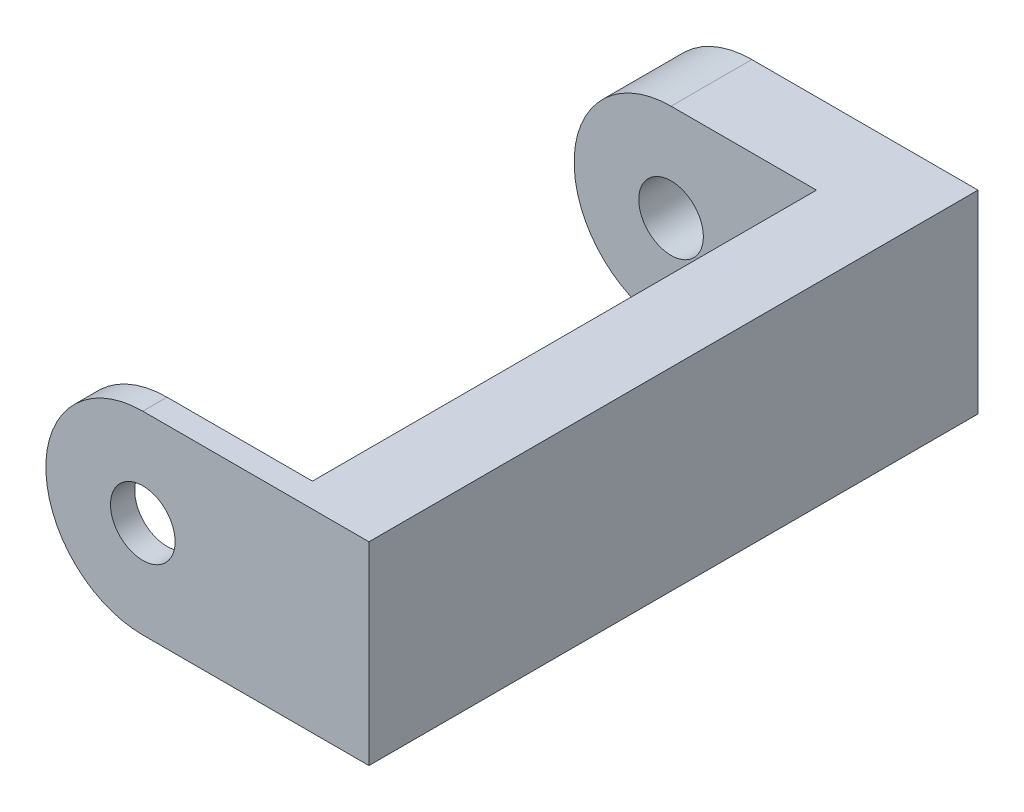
ISO-10303-21;
HEADER;
FILE_DESCRIPTION(('STEP AP214'),'2;1');
FILE_NAME('part.step','',(''),(''),'','','');
FILE_SCHEMA(('AUTOMOTIVE_DESIGN { 1 0 10303 214 1 1 1 1 }'));
ENDSEC;
DATA;
#1=APPLICATION_CONTEXT('core data for automotive mechanical design processes');
#2=APPLICATION_PROTOCOL_DEFINITION('international standard','automotive_design',2000,#1);
#3=PRODUCT_CONTEXT('',#1,'mechanical');
#4=PRODUCT('Part','Part','',(#3));
#5=PRODUCT_RELATED_PRODUCT_CATEGORY('part','',(#4));
#6=PRODUCT_DEFINITION_FORMATION('','',#4);
#7=PRODUCT_DEFINITION_CONTEXT('part definition',#1,'design');
#8=PRODUCT_DEFINITION('design','',#6,#7);
#9=PRODUCT_DEFINITION_SHAPE('','',#8);
#10=(LENGTH_UNIT() NAMED_UNIT(*) SI_UNIT(.MILLI.,.METRE.));
#11=(NAMED_UNIT(*) PLANE_ANGLE_UNIT() SI_UNIT($,.RADIAN.));
#12=(NAMED_UNIT(*) SI_UNIT($,.STERADIAN.) SOLID_ANGLE_UNIT());
#13=UNCERTAINTY_MEASURE_WITH_UNIT(LENGTH_MEASURE(1.E-05),#10,'distance_accuracy_value','');
#14=(GEOMETRIC_REPRESENTATION_CONTEXT(3) GLOBAL_UNCERTAINTY_ASSIGNED_CONTEXT((#13)) GLOBAL_UNIT_ASSIGNED_CONTEXT((#10,
#11,#12)) REPRESENTATION_CONTEXT('',''));
#15=CARTESIAN_POINT('',(0.,0.,0.));
#16=DIRECTION('',(0.,0.,1.));
#17=DIRECTION('',(1.,0.,0.));
#18=AXIS2_PLACEMENT_3D('',#15,#16,#17);
#19=CARTESIAN_POINT('',(0.,0.,75.4));
#20=DIRECTION('',(0.,0.,-1.));
#21=DIRECTION('',(-1.,0.,0.));
#22=AXIS2_PLACEMENT_3D('',#19,#20,#21);
#23=CYLINDRICAL_SURFACE('',#22,12.);
#24=DIRECTION('',(0.,0.,-1.));
#25=VECTOR('',#24,1.);
#26=CARTESIAN_POINT('',(0.,-12.,75.4));
#27=LINE('',#26,#25);
#28=CARTESIAN_POINT('',(0.,-12.,10.));
#29=VERTEX_POINT('',#28);
#30=CARTESIAN_POINT('',(0.,-12.,0.));
#31=VERTEX_POINT('',#30);
#32=EDGE_CURVE('E196',#29,#31,#27,.T.);
#33=ORIENTED_EDGE('',*,*,#32,.F.);
#34=CARTESIAN_POINT('',(0.,0.,9.99999999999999));
#35=DIRECTION('',(0.,0.,-1.));
#36=DIRECTION('',(-1.,0.,0.));
#37=AXIS2_PLACEMENT_3D('',#34,#35,#36);
#38=CIRCLE('',#37,12.);
#39=CARTESIAN_POINT('',(0.,12.,9.99999999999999));
#40=VERTEX_POINT('',#39);
#41=EDGE_CURVE('E132',#29,#40,#38,.T.);
#42=ORIENTED_EDGE('',*,*,#41,.T.);
#43=DIRECTION('',(0.,0.,-1.));
#44=VECTOR('',#43,1.);
#45=CARTESIAN_POINT('',(0.,12.,75.4));
#46=LINE('',#45,#44);
#47=CARTESIAN_POINT('',(0.,12.,0.));
#48=VERTEX_POINT('',#47);
#49=EDGE_CURVE('E199',#40,#48,#46,.T.);
#50=ORIENTED_EDGE('',*,*,#49,.T.);
#51=CARTESIAN_POINT('',(0.,0.,0.));
#52=DIRECTION('',(0.,0.,1.));
#53=DIRECTION('',(1.,0.,0.));
#54=AXIS2_PLACEMENT_3D('',#51,#52,#53);
#55=CIRCLE('',#54,12.);
#56=EDGE_CURVE('E181',#48,#31,#55,.T.);
#57=ORIENTED_EDGE('',*,*,#56,.T.);
#58=EDGE_LOOP('',(#33,#42,#50,#57));
#59=FACE_BOUND('',#58,.T.);
#60=ADVANCED_FACE('F45',(#59),#23,.T.);
#61=CARTESIAN_POINT('',(0.,12.,75.4));
#62=DIRECTION('',(0.,1.,0.));
#63=DIRECTION('',(0.,0.,1.));
#64=AXIS2_PLACEMENT_3D('',#61,#62,#63);
#65=PLANE('',#64);
#66=DIRECTION('',(-1.,0.,0.));
#67=VECTOR('',#66,1.);
#68=CARTESIAN_POINT('',(0.,12.,9.99999999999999));
#69=LINE('',#68,#67);
#70=CARTESIAN_POINT('',(18.,12.,10.));
#71=VERTEX_POINT('',#70);
#72=EDGE_CURVE('E160',#71,#40,#69,.T.);
#73=ORIENTED_EDGE('',*,*,#72,.F.);
#74=DIRECTION('',(0.,0.,-1.));
#75=VECTOR('',#74,1.);
#76=CARTESIAN_POINT('',(18.,12.,75.4));
#77=LINE('',#76,#75);
#78=CARTESIAN_POINT('',(18.,12.,72.4));
#79=VERTEX_POINT('',#78);
#80=EDGE_CURVE('E123',#79,#71,#77,.T.);
#81=ORIENTED_EDGE('',*,*,#80,.F.);
#82=DIRECTION('',(1.,0.,0.));
#83=VECTOR('',#82,1.);
#84=CARTESIAN_POINT('',(0.,12.,72.4));
#85=LINE('',#84,#83);
#86=CARTESIAN_POINT('',(0.,12.,72.4));
#87=VERTEX_POINT('',#86);
#88=EDGE_CURVE('E155',#87,#79,#85,.T.);
#89=ORIENTED_EDGE('',*,*,#88,.F.);
#90=CARTESIAN_POINT('',(0.,12.,75.4));
#91=VERTEX_POINT('',#90);
#92=EDGE_CURVE('E54',#91,#87,#46,.T.);
#93=ORIENTED_EDGE('',*,*,#92,.F.);
#94=DIRECTION('',(1.,0.,0.));
#95=VECTOR('',#94,1.);
#96=CARTESIAN_POINT('',(0.,12.,75.4));
#97=LINE('',#96,#95);
#98=CARTESIAN_POINT('',(28.,12.,75.4));
#99=VERTEX_POINT('',#98);
#100=EDGE_CURVE('E166',#91,#99,#97,.T.);
#101=ORIENTED_EDGE('',*,*,#100,.T.);
#102=DIRECTION('',(0.,0.,-1.));
#103=VECTOR('',#102,1.);
#104=CARTESIAN_POINT('',(28.,12.,75.4));
#105=LINE('',#104,#103);
#106=CARTESIAN_POINT('',(28.,12.,0.));
#107=VERTEX_POINT('',#106);
#108=EDGE_CURVE('E91',#99,#107,#105,.T.);
#109=ORIENTED_EDGE('',*,*,#108,.T.);
#110=DIRECTION('',(1.,0.,0.));
#111=VECTOR('',#110,1.);
#112=CARTESIAN_POINT('',(0.,12.,0.));
#113=LINE('',#112,#111);
#114=EDGE_CURVE('E165',#48,#107,#113,.T.);
#115=ORIENTED_EDGE('',*,*,#114,.F.);
#116=ORIENTED_EDGE('',*,*,#49,.F.);
#117=EDGE_LOOP('',(#73,#81,#89,#93,#101,#109,#115,#116));
#118=FACE_BOUND('',#117,.T.);
#119=ADVANCED_FACE('F47',(#118),#65,.T.);
#120=ORIENTED_EDGE('',*,*,#92,.T.);
#121=CARTESIAN_POINT('',(0.,0.,72.4));
#122=DIRECTION('',(0.,0.,1.));
#123=DIRECTION('',(1.,0.,0.));
#124=AXIS2_PLACEMENT_3D('',#121,#122,#123);
#125=CIRCLE('',#124,12.);
#126=CARTESIAN_POINT('',(0.,-12.,72.4));
#127=VERTEX_POINT('',#126);
#128=EDGE_CURVE('E127',#87,#127,#125,.T.);
#129=ORIENTED_EDGE('',*,*,#128,.T.);
#130=CARTESIAN_POINT('',(0.,-12.,75.4));
#131=VERTEX_POINT('',#130);
#132=EDGE_CURVE('E197',#131,#127,#27,.T.);
#133=ORIENTED_EDGE('',*,*,#132,.F.);
#134=CARTESIAN_POINT('',(0.,0.,75.4));
#135=DIRECTION('',(0.,0.,1.));
#136=DIRECTION('',(1.,0.,0.));
#137=AXIS2_PLACEMENT_3D('',#134,#135,#136);
#138=CIRCLE('',#137,12.);
#139=EDGE_CURVE('E169',#91,#131,#138,.T.);
#140=ORIENTED_EDGE('',*,*,#139,.F.);
#141=EDGE_LOOP('',(#120,#129,#133,#140));
#142=FACE_BOUND('',#141,.T.);
#143=ADVANCED_FACE('F211',(#142),#23,.T.);
#144=CARTESIAN_POINT('',(0.,-12.,75.4));
#145=DIRECTION('',(0.,1.,0.));
#146=DIRECTION('',(0.,0.,1.));
#147=AXIS2_PLACEMENT_3D('',#144,#145,#146);
#148=PLANE('',#147);
#149=DIRECTION('',(0.,0.,1.));
#150=VECTOR('',#149,1.);
#151=CARTESIAN_POINT('',(18.,-12.,10.));
#152=LINE('',#151,#150);
#153=CARTESIAN_POINT('',(18.,-12.,10.));
#154=VERTEX_POINT('',#153);
#155=CARTESIAN_POINT('',(18.,-12.,72.4));
#156=VERTEX_POINT('',#155);
#157=EDGE_CURVE('E61',#154,#156,#152,.T.);
#158=ORIENTED_EDGE('',*,*,#157,.F.);
#159=DIRECTION('',(-1.,0.,0.));
#160=VECTOR('',#159,1.);
#161=CARTESIAN_POINT('',(0.,-12.,9.99999999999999));
#162=LINE('',#161,#160);
#163=EDGE_CURVE('E11',#154,#29,#162,.T.);
#164=ORIENTED_EDGE('',*,*,#163,.T.);
#165=ORIENTED_EDGE('',*,*,#32,.T.);
#166=DIRECTION('',(1.,0.,0.));
#167=VECTOR('',#166,1.);
#168=CARTESIAN_POINT('',(0.,-12.,0.));
#169=LINE('',#168,#167);
#170=CARTESIAN_POINT('',(28.,-12.,0.));
#171=VERTEX_POINT('',#170);
#172=EDGE_CURVE('E185',#31,#171,#169,.T.);
#173=ORIENTED_EDGE('',*,*,#172,.T.);
#174=DIRECTION('',(0.,0.,-1.));
#175=VECTOR('',#174,1.);
#176=CARTESIAN_POINT('',(28.,-12.,75.4));
#177=LINE('',#176,#175);
#178=CARTESIAN_POINT('',(28.,-12.,75.4));
#179=VERTEX_POINT('',#178);
#180=EDGE_CURVE('E192',#179,#171,#177,.T.);
#181=ORIENTED_EDGE('',*,*,#180,.F.);
#182=DIRECTION('',(1.,0.,0.));
#183=VECTOR('',#182,1.);
#184=CARTESIAN_POINT('',(0.,-12.,75.4));
#185=LINE('',#184,#183);
#186=EDGE_CURVE('E173',#131,#179,#185,.T.);
#187=ORIENTED_EDGE('',*,*,#186,.F.);
#188=ORIENTED_EDGE('',*,*,#132,.T.);
#189=DIRECTION('',(-1.,0.,0.));
#190=VECTOR('',#189,1.);
#191=CARTESIAN_POINT('',(18.,-12.,72.4));
#192=LINE('',#191,#190);
#193=EDGE_CURVE('E138',#156,#127,#192,.T.);
#194=ORIENTED_EDGE('',*,*,#193,.F.);
#195=EDGE_LOOP('',(#158,#164,#165,#173,#181,#187,#188,#194));
#196=FACE_BOUND('',#195,.T.);
#197=ADVANCED_FACE('F136',(#196),#148,.F.);
#198=CARTESIAN_POINT('',(28.,0.,75.4));
#199=DIRECTION('',(-1.,0.,0.));
#200=DIRECTION('',(0.,0.,1.));
#201=AXIS2_PLACEMENT_3D('',#198,#199,#200);
#202=PLANE('',#201);
#203=DIRECTION('',(0.,1.,0.));
#204=VECTOR('',#203,1.);
#205=CARTESIAN_POINT('',(28.,0.,0.));
#206=LINE('',#205,#204);
#207=EDGE_CURVE('E170',#171,#107,#206,.T.);
#208=ORIENTED_EDGE('',*,*,#207,.T.);
#209=ORIENTED_EDGE('',*,*,#108,.F.);
#210=DIRECTION('',(0.,1.,0.));
#211=VECTOR('',#210,1.);
#212=CARTESIAN_POINT('',(28.,0.,75.4));
#213=LINE('',#212,#211);
#214=EDGE_CURVE('E70',#179,#99,#213,.T.);
#215=ORIENTED_EDGE('',*,*,#214,.F.);
#216=ORIENTED_EDGE('',*,*,#180,.T.);
#217=EDGE_LOOP('',(#208,#209,#215,#216));
#218=FACE_BOUND('',#217,.T.);
#219=ADVANCED_FACE('F222',(#218),#202,.F.);
#220=CARTESIAN_POINT('',(0.,0.,75.4));
#221=DIRECTION('',(0.,0.,1.));
#222=DIRECTION('',(1.,0.,0.));
#223=AXIS2_PLACEMENT_3D('',#220,#221,#222);
#224=PLANE('',#223);
#225=CARTESIAN_POINT('',(0.,0.,75.4));
#226=DIRECTION('',(0.,0.,1.));
#227=DIRECTION('',(1.,0.,0.));
#228=AXIS2_PLACEMENT_3D('',#225,#226,#227);
#229=CIRCLE('',#228,4.);
#230=CARTESIAN_POINT('',(4.,0.,75.4));
#231=VERTEX_POINT('',#230);
#232=EDGE_CURVE('E146',#231,#231,#229,.T.);
#233=ORIENTED_EDGE('',*,*,#232,.F.);
#234=EDGE_LOOP('',(#233));
#235=FACE_BOUND('',#234,.T.);
#236=ORIENTED_EDGE('',*,*,#100,.F.);
#237=ORIENTED_EDGE('',*,*,#139,.T.);
#238=ORIENTED_EDGE('',*,*,#186,.T.);
#239=ORIENTED_EDGE('',*,*,#214,.T.);
#240=EDGE_LOOP('',(#236,#237,#238,#239));
#241=FACE_BOUND('',#240,.T.);
#242=ADVANCED_FACE('F224',(#235,#241),#224,.T.);
#243=CARTESIAN_POINT('',(0.,0.,0.));
#244=DIRECTION('',(0.,0.,1.));
#245=DIRECTION('',(1.,0.,0.));
#246=AXIS2_PLACEMENT_3D('',#243,#244,#245);
#247=PLANE('',#246);
#248=CARTESIAN_POINT('',(0.,0.,0.));
#249=DIRECTION('',(0.,0.,1.));
#250=DIRECTION('',(1.,0.,0.));
#251=AXIS2_PLACEMENT_3D('',#248,#249,#250);
#252=CIRCLE('',#251,4.);
#253=CARTESIAN_POINT('',(4.,0.,0.));
#254=VERTEX_POINT('',#253);
#255=EDGE_CURVE('E253',#254,#254,#252,.T.);
#256=ORIENTED_EDGE('',*,*,#255,.T.);
#257=EDGE_LOOP('',(#256));
#258=FACE_BOUND('',#257,.T.);
#259=ORIENTED_EDGE('',*,*,#114,.T.);
#260=ORIENTED_EDGE('',*,*,#207,.F.);
#261=ORIENTED_EDGE('',*,*,#172,.F.);
#262=ORIENTED_EDGE('',*,*,#56,.F.);
#263=EDGE_LOOP('',(#259,#260,#261,#262));
#264=FACE_BOUND('',#263,.T.);
#265=ADVANCED_FACE('F208',(#258,#264),#247,.F.);
#266=CARTESIAN_POINT('',(18.,63.4,10.));
#267=DIRECTION('',(1.,0.,0.));
#268=DIRECTION('',(0.,0.,-1.));
#269=AXIS2_PLACEMENT_3D('',#266,#267,#268);
#270=PLANE('',#269);
#271=ORIENTED_EDGE('',*,*,#80,.T.);
#272=DIRECTION('',(0.,-1.,0.));
#273=VECTOR('',#272,1.);
#274=CARTESIAN_POINT('',(18.,63.4,10.));
#275=LINE('',#274,#273);
#276=EDGE_CURVE('E119',#71,#154,#275,.T.);
#277=ORIENTED_EDGE('',*,*,#276,.T.);
#278=ORIENTED_EDGE('',*,*,#157,.T.);
#279=DIRECTION('',(0.,-1.,0.));
#280=VECTOR('',#279,1.);
#281=CARTESIAN_POINT('',(18.,63.4,72.4));
#282=LINE('',#281,#280);
#283=EDGE_CURVE('E128',#79,#156,#282,.T.);
#284=ORIENTED_EDGE('',*,*,#283,.F.);
#285=EDGE_LOOP('',(#271,#277,#278,#284));
#286=FACE_BOUND('',#285,.T.);
#287=ADVANCED_FACE('F121',(#286),#270,.F.);
#288=CARTESIAN_POINT('',(18.,63.4,10.));
#289=DIRECTION('',(0.,0.,-1.));
#290=DIRECTION('',(-1.,0.,0.));
#291=AXIS2_PLACEMENT_3D('',#288,#289,#290);
#292=PLANE('',#291);
#293=CARTESIAN_POINT('',(0.,0.,10.));
#294=DIRECTION('',(0.,0.,1.));
#295=DIRECTION('',(1.,0.,0.));
#296=AXIS2_PLACEMENT_3D('',#293,#294,#295);
#297=CIRCLE('',#296,3.99999999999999);
#298=CARTESIAN_POINT('',(3.99999999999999,0.,10.));
#299=VERTEX_POINT('',#298);
#300=EDGE_CURVE('E256',#299,#299,#297,.T.);
#301=ORIENTED_EDGE('',*,*,#300,.F.);
#302=EDGE_LOOP('',(#301));
#303=FACE_BOUND('',#302,.T.);
#304=ORIENTED_EDGE('',*,*,#72,.T.);
#305=ORIENTED_EDGE('',*,*,#41,.F.);
#306=ORIENTED_EDGE('',*,*,#163,.F.);
#307=ORIENTED_EDGE('',*,*,#276,.F.);
#308=EDGE_LOOP('',(#304,#305,#306,#307));
#309=FACE_BOUND('',#308,.T.);
#310=ADVANCED_FACE('F130',(#303,#309),#292,.F.);
#311=CARTESIAN_POINT('',(18.,63.4,72.4));
#312=DIRECTION('',(0.,0.,1.));
#313=DIRECTION('',(1.,0.,0.));
#314=AXIS2_PLACEMENT_3D('',#311,#312,#313);
#315=PLANE('',#314);
#316=CARTESIAN_POINT('',(0.,0.,72.4));
#317=DIRECTION('',(0.,0.,1.));
#318=DIRECTION('',(1.,0.,0.));
#319=AXIS2_PLACEMENT_3D('',#316,#317,#318);
#320=CIRCLE('',#319,4.);
#321=CARTESIAN_POINT('',(4.,0.,72.4));
#322=VERTEX_POINT('',#321);
#323=EDGE_CURVE('E140',#322,#322,#320,.T.);
#324=ORIENTED_EDGE('',*,*,#323,.T.);
#325=EDGE_LOOP('',(#324));
#326=FACE_BOUND('',#325,.T.);
#327=ORIENTED_EDGE('',*,*,#88,.T.);
#328=ORIENTED_EDGE('',*,*,#283,.T.);
#329=ORIENTED_EDGE('',*,*,#193,.T.);
#330=ORIENTED_EDGE('',*,*,#128,.F.);
#331=EDGE_LOOP('',(#327,#328,#329,#330));
#332=FACE_BOUND('',#331,.T.);
#333=ADVANCED_FACE('F234',(#326,#332),#315,.F.);
#334=CARTESIAN_POINT('',(0.,0.,75.4));
#335=DIRECTION('',(0.,0.,1.));
#336=DIRECTION('',(1.,0.,0.));
#337=AXIS2_PLACEMENT_3D('',#334,#335,#336);
#338=CYLINDRICAL_SURFACE('',#337,4.);
#339=ORIENTED_EDGE('',*,*,#323,.F.);
#340=EDGE_LOOP('',(#339));
#341=FACE_BOUND('',#340,.T.);
#342=ORIENTED_EDGE('',*,*,#232,.T.);
#343=EDGE_LOOP('',(#342));
#344=FACE_BOUND('',#343,.T.);
#345=ADVANCED_FACE('F237',(#341,#344),#338,.F.);
#346=CARTESIAN_POINT('',(0.,0.,10.));
#347=DIRECTION('',(0.,0.,1.));
#348=DIRECTION('',(1.,0.,0.));
#349=AXIS2_PLACEMENT_3D('',#346,#347,#348);
#350=CYLINDRICAL_SURFACE('',#349,3.99999999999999);
#351=ORIENTED_EDGE('',*,*,#255,.F.);
#352=EDGE_LOOP('',(#351));
#353=FACE_BOUND('',#352,.T.);
#354=ORIENTED_EDGE('',*,*,#300,.T.);
#355=EDGE_LOOP('',(#354));
#356=FACE_BOUND('',#355,.T.);
#357=ADVANCED_FACE('F244',(#353,#356),#350,.F.);
#358=CLOSED_SHELL('',(#60,#119,#143,#197,#219,#242,#265,#287,#310,#333,#345,#357));
#359=MANIFOLD_SOLID_BREP('B2',#358);
#360=ADVANCED_BREP_SHAPE_REPRESENTATION('',(#18,#359),#14);
#361=SHAPE_DEFINITION_REPRESENTATION(#9,#360);
ENDSEC;
END-ISO-10303-21;
